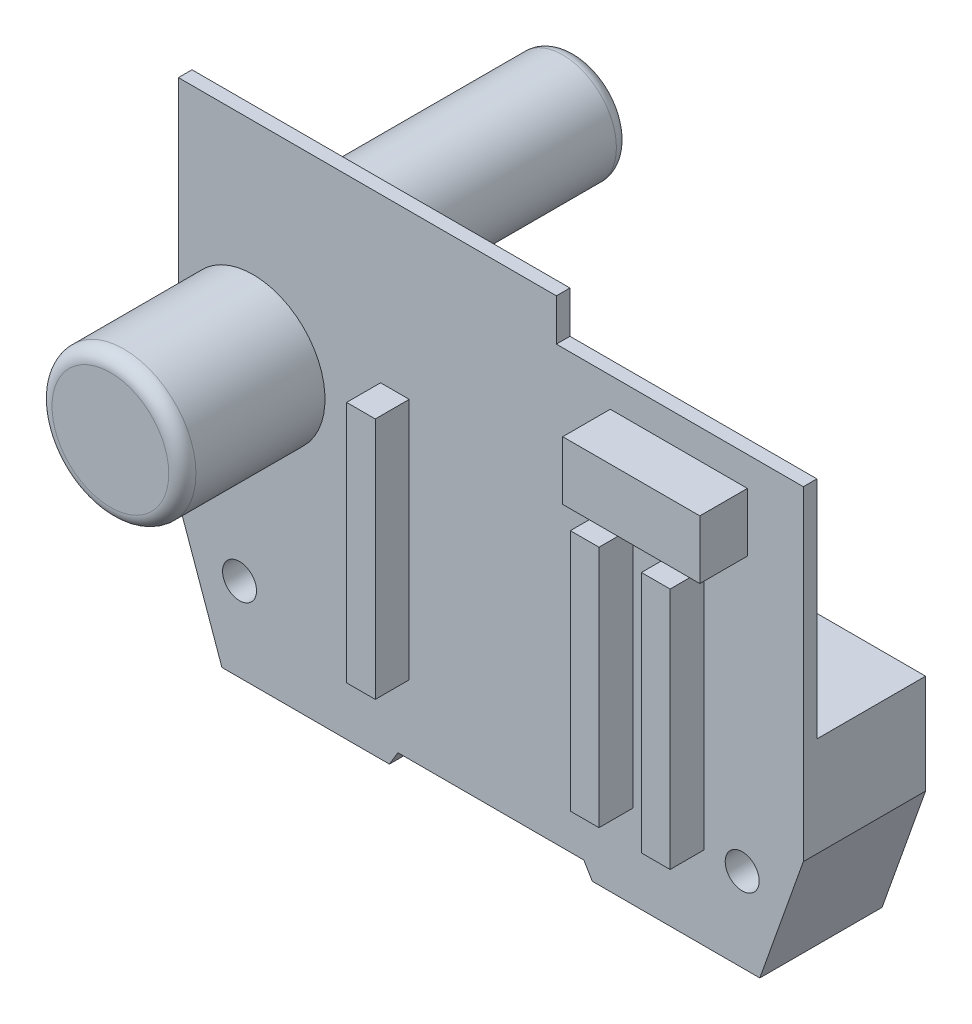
ISO-10303-21;
HEADER;
FILE_DESCRIPTION(('STEP AP214'),'2;1');
FILE_NAME('part.step','',(''),(''),'','','');
FILE_SCHEMA(('AUTOMOTIVE_DESIGN { 1 0 10303 214 1 1 1 1 }'));
ENDSEC;
DATA;
#1=APPLICATION_CONTEXT('core data for automotive mechanical design processes');
#2=APPLICATION_PROTOCOL_DEFINITION('international standard','automotive_design',2000,#1);
#3=PRODUCT_CONTEXT('',#1,'mechanical');
#4=PRODUCT('Part','Part','',(#3));
#5=PRODUCT_RELATED_PRODUCT_CATEGORY('part','',(#4));
#6=PRODUCT_DEFINITION_FORMATION('','',#4);
#7=PRODUCT_DEFINITION_CONTEXT('part definition',#1,'design');
#8=PRODUCT_DEFINITION('design','',#6,#7);
#9=PRODUCT_DEFINITION_SHAPE('','',#8);
#10=(LENGTH_UNIT() NAMED_UNIT(*) SI_UNIT(.MILLI.,.METRE.));
#11=(NAMED_UNIT(*) PLANE_ANGLE_UNIT() SI_UNIT($,.RADIAN.));
#12=(NAMED_UNIT(*) SI_UNIT($,.STERADIAN.) SOLID_ANGLE_UNIT());
#13=UNCERTAINTY_MEASURE_WITH_UNIT(LENGTH_MEASURE(1.E-05),#10,'distance_accuracy_value','');
#14=(GEOMETRIC_REPRESENTATION_CONTEXT(3) GLOBAL_UNCERTAINTY_ASSIGNED_CONTEXT((#13)) GLOBAL_UNIT_ASSIGNED_CONTEXT((#10,
#11,#12)) REPRESENTATION_CONTEXT('',''));
#15=CARTESIAN_POINT('',(0.,0.,0.));
#16=DIRECTION('',(0.,0.,1.));
#17=DIRECTION('',(1.,0.,0.));
#18=AXIS2_PLACEMENT_3D('',#15,#16,#17);
#19=CARTESIAN_POINT('',(-92.,0.,0.));
#20=DIRECTION('',(0.,0.,1.));
#21=DIRECTION('',(1.,0.,0.));
#22=AXIS2_PLACEMENT_3D('',#19,#20,#21);
#23=PLANE('',#22);
#24=DIRECTION('',(1.,0.,0.));
#25=VECTOR('',#24,1.);
#26=CARTESIAN_POINT('',(0.,32.6877580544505,0.));
#27=LINE('',#26,#25);
#28=CARTESIAN_POINT('',(-92.,32.6877580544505,0.));
#29=VERTEX_POINT('',#28);
#30=CARTESIAN_POINT('',(0.,32.6877580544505,0.));
#31=VERTEX_POINT('',#30);
#32=EDGE_CURVE('E46',#29,#31,#27,.T.);
#33=ORIENTED_EDGE('',*,*,#32,.F.);
#34=DIRECTION('',(0.,-1.,0.));
#35=VECTOR('',#34,1.);
#36=CARTESIAN_POINT('',(-92.,72.,0.));
#37=LINE('',#36,#35);
#38=CARTESIAN_POINT('',(-92.,72.,0.));
#39=VERTEX_POINT('',#38);
#40=EDGE_CURVE('E236',#39,#29,#37,.T.);
#41=ORIENTED_EDGE('',*,*,#40,.F.);
#42=DIRECTION('',(-1.,0.,0.));
#43=VECTOR('',#42,1.);
#44=CARTESIAN_POINT('',(-92.,72.,0.));
#45=LINE('',#44,#43);
#46=CARTESIAN_POINT('',(-36.3563524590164,72.,0.));
#47=VERTEX_POINT('',#46);
#48=EDGE_CURVE('E562',#47,#39,#45,.T.);
#49=ORIENTED_EDGE('',*,*,#48,.F.);
#50=DIRECTION('',(0.,1.,0.));
#51=VECTOR('',#50,1.);
#52=CARTESIAN_POINT('',(-36.3563524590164,72.,0.));
#53=LINE('',#52,#51);
#54=CARTESIAN_POINT('',(-36.3563524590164,65.8422131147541,0.));
#55=VERTEX_POINT('',#54);
#56=EDGE_CURVE('E564',#55,#47,#53,.T.);
#57=ORIENTED_EDGE('',*,*,#56,.F.);
#58=DIRECTION('',(-1.,0.,0.));
#59=VECTOR('',#58,1.);
#60=CARTESIAN_POINT('',(-36.3563524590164,65.8422131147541,0.));
#61=LINE('',#60,#59);
#62=CARTESIAN_POINT('',(0.,65.8422131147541,0.));
#63=VERTEX_POINT('',#62);
#64=EDGE_CURVE('E231',#63,#55,#61,.T.);
#65=ORIENTED_EDGE('',*,*,#64,.F.);
#66=DIRECTION('',(0.,1.,0.));
#67=VECTOR('',#66,1.);
#68=CARTESIAN_POINT('',(0.,65.8422131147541,0.));
#69=LINE('',#68,#67);
#70=EDGE_CURVE('E228',#31,#63,#69,.T.);
#71=ORIENTED_EDGE('',*,*,#70,.F.);
#72=EDGE_LOOP('',(#33,#41,#49,#57,#65,#71));
#73=FACE_BOUND('',#72,.T.);
#74=CARTESIAN_POINT('',(-71.3971763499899,59.3113238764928,0.));
#75=DIRECTION('',(0.,0.,1.));
#76=DIRECTION('',(1.,0.,0.));
#77=AXIS2_PLACEMENT_3D('',#74,#75,#76);
#78=CIRCLE('',#77,7.87992780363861);
#79=CARTESIAN_POINT('',(-63.5172485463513,59.3113238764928,0.));
#80=VERTEX_POINT('',#79);
#81=EDGE_CURVE('E266',#80,#80,#78,.F.);
#82=ORIENTED_EDGE('',*,*,#81,.F.);
#83=EDGE_LOOP('',(#82));
#84=FACE_BOUND('',#83,.T.);
#85=ADVANCED_FACE('F29',(#73,#84),#23,.F.);
#86=CARTESIAN_POINT('',(-92.,0.,2.));
#87=DIRECTION('',(0.,0.,1.));
#88=DIRECTION('',(1.,0.,0.));
#89=AXIS2_PLACEMENT_3D('',#86,#87,#88);
#90=PLANE('',#89);
#91=DIRECTION('',(-1.,0.,0.));
#92=VECTOR('',#91,1.);
#93=CARTESIAN_POINT('',(-29.2991252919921,48.0878118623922,2.));
#94=LINE('',#93,#92);
#95=CARTESIAN_POINT('',(-25.0800503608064,48.0878118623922,2.));
#96=VERTEX_POINT('',#95);
#97=CARTESIAN_POINT('',(-29.2991252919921,48.0878118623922,2.));
#98=VERTEX_POINT('',#97);
#99=EDGE_CURVE('E417',#96,#98,#94,.T.);
#100=ORIENTED_EDGE('',*,*,#99,.F.);
#101=DIRECTION('',(0.,1.,0.));
#102=VECTOR('',#101,1.);
#103=CARTESIAN_POINT('',(-25.0800503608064,48.0878118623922,2.));
#104=LINE('',#103,#102);
#105=CARTESIAN_POINT('',(-25.0800503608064,12.3274283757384,2.));
#106=VERTEX_POINT('',#105);
#107=EDGE_CURVE('E414',#106,#96,#104,.T.);
#108=ORIENTED_EDGE('',*,*,#107,.F.);
#109=DIRECTION('',(1.,0.,0.));
#110=VECTOR('',#109,1.);
#111=CARTESIAN_POINT('',(-29.2991252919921,12.3274283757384,2.));
#112=LINE('',#111,#110);
#113=CARTESIAN_POINT('',(-29.2991252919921,12.3274283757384,2.));
#114=VERTEX_POINT('',#113);
#115=EDGE_CURVE('E422',#114,#106,#112,.T.);
#116=ORIENTED_EDGE('',*,*,#115,.F.);
#117=DIRECTION('',(0.,-1.,0.));
#118=VECTOR('',#117,1.);
#119=CARTESIAN_POINT('',(-29.2991252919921,48.0878118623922,2.));
#120=LINE('',#119,#118);
#121=EDGE_CURVE('E419',#98,#114,#120,.T.);
#122=ORIENTED_EDGE('',*,*,#121,.F.);
#123=EDGE_LOOP('',(#100,#108,#116,#122));
#124=FACE_BOUND('',#123,.T.);
#125=DIRECTION('',(1.,0.,0.));
#126=VECTOR('',#125,1.);
#127=CARTESIAN_POINT('',(-28.4199991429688,52.8750444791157,2.));
#128=LINE('',#127,#126);
#129=CARTESIAN_POINT('',(-28.4199991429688,52.8750444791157,2.));
#130=VERTEX_POINT('',#129);
#131=CARTESIAN_POINT('',(-8.23514536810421,52.8750444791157,2.));
#132=VERTEX_POINT('',#131);
#133=EDGE_CURVE('E475',#130,#132,#128,.T.);
#134=ORIENTED_EDGE('',*,*,#133,.F.);
#135=DIRECTION('',(0.,-1.,0.));
#136=VECTOR('',#135,1.);
#137=CARTESIAN_POINT('',(-28.4199991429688,61.506325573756,2.));
#138=LINE('',#137,#136);
#139=CARTESIAN_POINT('',(-28.4199991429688,61.506325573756,2.));
#140=VERTEX_POINT('',#139);
#141=EDGE_CURVE('E472',#140,#130,#138,.T.);
#142=ORIENTED_EDGE('',*,*,#141,.F.);
#143=DIRECTION('',(-1.,0.,0.));
#144=VECTOR('',#143,1.);
#145=CARTESIAN_POINT('',(-28.4199991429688,61.506325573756,2.));
#146=LINE('',#145,#144);
#147=CARTESIAN_POINT('',(-8.23514536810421,61.506325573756,2.));
#148=VERTEX_POINT('',#147);
#149=EDGE_CURVE('E480',#148,#140,#146,.T.);
#150=ORIENTED_EDGE('',*,*,#149,.F.);
#151=DIRECTION('',(0.,1.,0.));
#152=VECTOR('',#151,1.);
#153=CARTESIAN_POINT('',(-8.23514536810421,61.506325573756,2.));
#154=LINE('',#153,#152);
#155=EDGE_CURVE('E477',#132,#148,#154,.T.);
#156=ORIENTED_EDGE('',*,*,#155,.F.);
#157=EDGE_LOOP('',(#134,#142,#150,#156));
#158=FACE_BOUND('',#157,.T.);
#159=CARTESIAN_POINT('',(-8.99999999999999,12.309631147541,2.));
#160=DIRECTION('',(0.,0.,1.));
#161=DIRECTION('',(-1.,0.,0.));
#162=AXIS2_PLACEMENT_3D('',#159,#160,#161);
#163=CIRCLE('',#162,2.5);
#164=CARTESIAN_POINT('',(-11.5,12.309631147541,2.));
#165=VERTEX_POINT('',#164);
#166=EDGE_CURVE('E504',#165,#165,#163,.T.);
#167=ORIENTED_EDGE('',*,*,#166,.F.);
#168=EDGE_LOOP('',(#167));
#169=FACE_BOUND('',#168,.T.);
#170=DIRECTION('',(0.,-1.,0.));
#171=VECTOR('',#170,1.);
#172=CARTESIAN_POINT('',(-92.,72.,2.));
#173=LINE('',#172,#171);
#174=CARTESIAN_POINT('',(-92.,72.,2.));
#175=VERTEX_POINT('',#174);
#176=CARTESIAN_POINT('',(-92.,18.0350409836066,2.));
#177=VERTEX_POINT('',#176);
#178=EDGE_CURVE('E560',#175,#177,#173,.T.);
#179=ORIENTED_EDGE('',*,*,#178,.T.);
#180=DIRECTION('',(0.334669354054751,-0.942335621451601,0.));
#181=VECTOR('',#180,1.);
#182=CARTESIAN_POINT('',(-92.,18.0350409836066,2.));
#183=LINE('',#182,#181);
#184=CARTESIAN_POINT('',(-85.5948770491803,0.,2.));
#185=VERTEX_POINT('',#184);
#186=EDGE_CURVE('E359',#177,#185,#183,.T.);
#187=ORIENTED_EDGE('',*,*,#186,.T.);
#188=DIRECTION('',(1.,0.,0.));
#189=VECTOR('',#188,1.);
#190=CARTESIAN_POINT('',(-85.5948770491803,0.,2.));
#191=LINE('',#190,#189);
#192=CARTESIAN_POINT('',(-60.9345193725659,0.,2.));
#193=VERTEX_POINT('',#192);
#194=EDGE_CURVE('E557',#185,#193,#191,.T.);
#195=ORIENTED_EDGE('',*,*,#194,.T.);
#196=DIRECTION('',(0.514507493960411,0.857485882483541,0.));
#197=VECTOR('',#196,1.);
#198=CARTESIAN_POINT('',(-60.9345193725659,0.,2.));
#199=LINE('',#198,#197);
#200=CARTESIAN_POINT('',(-59.6824641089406,2.08669402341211,2.));
#201=VERTEX_POINT('',#200);
#202=EDGE_CURVE('E555',#193,#201,#199,.T.);
#203=ORIENTED_EDGE('',*,*,#202,.T.);
#204=DIRECTION('',(1.,0.,0.));
#205=VECTOR('',#204,1.);
#206=CARTESIAN_POINT('',(-59.6824641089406,2.08669402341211,2.));
#207=LINE('',#206,#205);
#208=CARTESIAN_POINT('',(-32.3175358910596,2.08669402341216,2.));
#209=VERTEX_POINT('',#208);
#210=EDGE_CURVE('E553',#201,#209,#207,.T.);
#211=ORIENTED_EDGE('',*,*,#210,.T.);
#212=DIRECTION('',(0.51450749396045,-0.857485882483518,0.));
#213=VECTOR('',#212,1.);
#214=CARTESIAN_POINT('',(-31.0654806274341,0.,2.));
#215=LINE('',#214,#213);
#216=CARTESIAN_POINT('',(-31.0654806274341,0.,2.));
#217=VERTEX_POINT('',#216);
#218=EDGE_CURVE('E551',#209,#217,#215,.T.);
#219=ORIENTED_EDGE('',*,*,#218,.T.);
#220=DIRECTION('',(1.,0.,0.));
#221=VECTOR('',#220,1.);
#222=CARTESIAN_POINT('',(-31.0654806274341,0.,2.));
#223=LINE('',#222,#221);
#224=CARTESIAN_POINT('',(-6.40512295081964,0.,2.));
#225=VERTEX_POINT('',#224);
#226=EDGE_CURVE('E549',#217,#225,#223,.T.);
#227=ORIENTED_EDGE('',*,*,#226,.T.);
#228=DIRECTION('',(0.334669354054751,0.942335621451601,0.));
#229=VECTOR('',#228,1.);
#230=CARTESIAN_POINT('',(0.,18.0350409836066,2.));
#231=LINE('',#230,#229);
#232=CARTESIAN_POINT('',(0.,18.0350409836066,2.));
#233=VERTEX_POINT('',#232);
#234=EDGE_CURVE('E547',#225,#233,#231,.T.);
#235=ORIENTED_EDGE('',*,*,#234,.T.);
#236=DIRECTION('',(0.,1.,0.));
#237=VECTOR('',#236,1.);
#238=CARTESIAN_POINT('',(0.,65.8422131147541,2.));
#239=LINE('',#238,#237);
#240=CARTESIAN_POINT('',(0.,65.8422131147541,2.));
#241=VERTEX_POINT('',#240);
#242=EDGE_CURVE('E545',#233,#241,#239,.T.);
#243=ORIENTED_EDGE('',*,*,#242,.T.);
#244=DIRECTION('',(-1.,0.,0.));
#245=VECTOR('',#244,1.);
#246=CARTESIAN_POINT('',(-36.3563524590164,65.8422131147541,2.));
#247=LINE('',#246,#245);
#248=CARTESIAN_POINT('',(-36.3563524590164,65.8422131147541,2.));
#249=VERTEX_POINT('',#248);
#250=EDGE_CURVE('E543',#241,#249,#247,.T.);
#251=ORIENTED_EDGE('',*,*,#250,.T.);
#252=DIRECTION('',(0.,1.,0.));
#253=VECTOR('',#252,1.);
#254=CARTESIAN_POINT('',(-36.3563524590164,72.,2.));
#255=LINE('',#254,#253);
#256=CARTESIAN_POINT('',(-36.3563524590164,72.,2.));
#257=VERTEX_POINT('',#256);
#258=EDGE_CURVE('E541',#249,#257,#255,.T.);
#259=ORIENTED_EDGE('',*,*,#258,.T.);
#260=DIRECTION('',(-1.,0.,0.));
#261=VECTOR('',#260,1.);
#262=CARTESIAN_POINT('',(-92.,72.,2.));
#263=LINE('',#262,#261);
#264=EDGE_CURVE('E539',#257,#175,#263,.T.);
#265=ORIENTED_EDGE('',*,*,#264,.T.);
#266=EDGE_LOOP('',(#179,#187,#195,#203,#211,#219,#227,#235,#243,#251,#259,#265));
#267=FACE_BOUND('',#266,.T.);
#268=CARTESIAN_POINT('',(-83.,12.309631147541,2.));
#269=DIRECTION('',(0.,0.,1.));
#270=DIRECTION('',(1.,0.,0.));
#271=AXIS2_PLACEMENT_3D('',#268,#269,#270);
#272=CIRCLE('',#271,2.5);
#273=CARTESIAN_POINT('',(-80.5,12.309631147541,2.));
#274=VERTEX_POINT('',#273);
#275=EDGE_CURVE('E506',#274,#274,#272,.T.);
#276=ORIENTED_EDGE('',*,*,#275,.F.);
#277=EDGE_LOOP('',(#276));
#278=FACE_BOUND('',#277,.T.);
#279=CARTESIAN_POINT('',(-81.0115867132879,41.7956883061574,2.));
#280=DIRECTION('',(0.,0.,1.));
#281=DIRECTION('',(1.,0.,0.));
#282=AXIS2_PLACEMENT_3D('',#279,#280,#281);
#283=CIRCLE('',#282,10.5931506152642);
#284=CARTESIAN_POINT('',(-91.6047373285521,41.7956883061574,2.));
#285=VERTEX_POINT('',#284);
#286=EDGE_CURVE('E501',#285,#285,#283,.T.);
#287=ORIENTED_EDGE('',*,*,#286,.F.);
#288=EDGE_LOOP('',(#287));
#289=FACE_BOUND('',#288,.T.);
#290=DIRECTION('',(1.,0.,0.));
#291=VECTOR('',#290,1.);
#292=CARTESIAN_POINT('',(-18.8329019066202,12.2283973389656,2.));
#293=LINE('',#292,#291);
#294=CARTESIAN_POINT('',(-18.8329019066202,12.2283973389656,2.));
#295=VERTEX_POINT('',#294);
#296=CARTESIAN_POINT('',(-14.6138269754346,12.2283973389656,2.));
#297=VERTEX_POINT('',#296);
#298=EDGE_CURVE('E446',#295,#297,#293,.T.);
#299=ORIENTED_EDGE('',*,*,#298,.F.);
#300=DIRECTION('',(0.,-1.,0.));
#301=VECTOR('',#300,1.);
#302=CARTESIAN_POINT('',(-18.8329019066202,47.9887808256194,2.));
#303=LINE('',#302,#301);
#304=CARTESIAN_POINT('',(-18.8329019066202,47.9887808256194,2.));
#305=VERTEX_POINT('',#304);
#306=EDGE_CURVE('E443',#305,#295,#303,.T.);
#307=ORIENTED_EDGE('',*,*,#306,.F.);
#308=DIRECTION('',(-1.,0.,0.));
#309=VECTOR('',#308,1.);
#310=CARTESIAN_POINT('',(-18.8329019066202,47.9887808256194,2.));
#311=LINE('',#310,#309);
#312=CARTESIAN_POINT('',(-14.6138269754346,47.9887808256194,2.));
#313=VERTEX_POINT('',#312);
#314=EDGE_CURVE('E451',#313,#305,#311,.T.);
#315=ORIENTED_EDGE('',*,*,#314,.F.);
#316=DIRECTION('',(0.,1.,0.));
#317=VECTOR('',#316,1.);
#318=CARTESIAN_POINT('',(-14.6138269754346,47.9887808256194,2.));
#319=LINE('',#318,#317);
#320=EDGE_CURVE('E448',#297,#313,#319,.T.);
#321=ORIENTED_EDGE('',*,*,#320,.F.);
#322=EDGE_LOOP('',(#299,#307,#315,#321));
#323=FACE_BOUND('',#322,.T.);
#324=DIRECTION('',(-1.,0.,0.));
#325=VECTOR('',#324,1.);
#326=CARTESIAN_POINT('',(-62.23495790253,47.9720799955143,2.));
#327=LINE('',#326,#325);
#328=CARTESIAN_POINT('',(-58.0158829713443,47.9720799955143,2.));
#329=VERTEX_POINT('',#328);
#330=CARTESIAN_POINT('',(-62.23495790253,47.9720799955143,2.));
#331=VERTEX_POINT('',#330);
#332=EDGE_CURVE('E390',#329,#331,#327,.T.);
#333=ORIENTED_EDGE('',*,*,#332,.F.);
#334=DIRECTION('',(0.,1.,0.));
#335=VECTOR('',#334,1.);
#336=CARTESIAN_POINT('',(-58.0158829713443,47.9720799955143,2.));
#337=LINE('',#336,#335);
#338=CARTESIAN_POINT('',(-58.0158829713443,12.2116965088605,2.));
#339=VERTEX_POINT('',#338);
#340=EDGE_CURVE('E255',#339,#329,#337,.T.);
#341=ORIENTED_EDGE('',*,*,#340,.F.);
#342=DIRECTION('',(1.,0.,0.));
#343=VECTOR('',#342,1.);
#344=CARTESIAN_POINT('',(-62.23495790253,12.2116965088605,2.));
#345=LINE('',#344,#343);
#346=CARTESIAN_POINT('',(-62.23495790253,12.2116965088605,2.));
#347=VERTEX_POINT('',#346);
#348=EDGE_CURVE('E394',#347,#339,#345,.T.);
#349=ORIENTED_EDGE('',*,*,#348,.F.);
#350=DIRECTION('',(0.,-1.,0.));
#351=VECTOR('',#350,1.);
#352=CARTESIAN_POINT('',(-62.23495790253,47.9720799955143,2.));
#353=LINE('',#352,#351);
#354=EDGE_CURVE('E392',#331,#347,#353,.T.);
#355=ORIENTED_EDGE('',*,*,#354,.F.);
#356=EDGE_LOOP('',(#333,#341,#349,#355));
#357=FACE_BOUND('',#356,.T.);
#358=ADVANCED_FACE('F303',(#124,#158,#169,#267,#278,#289,#323,#357),#90,.T.);
#359=CARTESIAN_POINT('',(-92.,72.,2.));
#360=DIRECTION('',(1.,0.,0.));
#361=DIRECTION('',(0.,0.,-1.));
#362=AXIS2_PLACEMENT_3D('',#359,#360,#361);
#363=PLANE('',#362);
#364=ORIENTED_EDGE('',*,*,#40,.T.);
#365=DIRECTION('',(0.,0.,1.));
#366=VECTOR('',#365,1.);
#367=CARTESIAN_POINT('',(-92.,32.6877580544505,-16.));
#368=LINE('',#367,#366);
#369=CARTESIAN_POINT('',(-92.,32.6877580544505,-16.));
#370=VERTEX_POINT('',#369);
#371=EDGE_CURVE('E246',#370,#29,#368,.T.);
#372=ORIENTED_EDGE('',*,*,#371,.F.);
#373=DIRECTION('',(0.,1.,0.));
#374=VECTOR('',#373,1.);
#375=CARTESIAN_POINT('',(-92.,18.0350409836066,-16.));
#376=LINE('',#375,#374);
#377=CARTESIAN_POINT('',(-92.,18.0350409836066,-16.));
#378=VERTEX_POINT('',#377);
#379=EDGE_CURVE('E364',#378,#370,#376,.T.);
#380=ORIENTED_EDGE('',*,*,#379,.F.);
#381=DIRECTION('',(0.,0.,-1.));
#382=VECTOR('',#381,1.);
#383=CARTESIAN_POINT('',(-92.,18.0350409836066,2.));
#384=LINE('',#383,#382);
#385=EDGE_CURVE('E270',#177,#378,#384,.T.);
#386=ORIENTED_EDGE('',*,*,#385,.F.);
#387=ORIENTED_EDGE('',*,*,#178,.F.);
#388=DIRECTION('',(0.,0.,-1.));
#389=VECTOR('',#388,1.);
#390=CARTESIAN_POINT('',(-92.,72.,2.));
#391=LINE('',#390,#389);
#392=EDGE_CURVE('E536',#175,#39,#391,.T.);
#393=ORIENTED_EDGE('',*,*,#392,.T.);
#394=EDGE_LOOP('',(#364,#372,#380,#386,#387,#393));
#395=FACE_BOUND('',#394,.T.);
#396=ADVANCED_FACE('F31',(#395),#363,.F.);
#397=CARTESIAN_POINT('',(-92.,18.0350409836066,2.));
#398=DIRECTION('',(0.942335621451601,0.334669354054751,0.));
#399=DIRECTION('',(-0.334669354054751,0.942335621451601,0.));
#400=AXIS2_PLACEMENT_3D('',#397,#398,#399);
#401=PLANE('',#400);
#402=ORIENTED_EDGE('',*,*,#385,.T.);
#403=DIRECTION('',(-0.334669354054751,0.942335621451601,0.));
#404=VECTOR('',#403,1.);
#405=CARTESIAN_POINT('',(-85.5948770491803,0.,-16.));
#406=LINE('',#405,#404);
#407=CARTESIAN_POINT('',(-85.5948770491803,0.,-16.));
#408=VERTEX_POINT('',#407);
#409=EDGE_CURVE('E247',#408,#378,#406,.T.);
#410=ORIENTED_EDGE('',*,*,#409,.F.);
#411=DIRECTION('',(0.,0.,-1.));
#412=VECTOR('',#411,1.);
#413=CARTESIAN_POINT('',(-85.5948770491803,0.,2.));
#414=LINE('',#413,#412);
#415=EDGE_CURVE('E362',#185,#408,#414,.T.);
#416=ORIENTED_EDGE('',*,*,#415,.F.);
#417=ORIENTED_EDGE('',*,*,#186,.F.);
#418=EDGE_LOOP('',(#402,#410,#416,#417));
#419=FACE_BOUND('',#418,.T.);
#420=ADVANCED_FACE('F346',(#419),#401,.F.);
#421=CARTESIAN_POINT('',(-85.5948770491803,0.,2.));
#422=DIRECTION('',(0.,1.,0.));
#423=DIRECTION('',(0.,0.,1.));
#424=AXIS2_PLACEMENT_3D('',#421,#422,#423);
#425=PLANE('',#424);
#426=ORIENTED_EDGE('',*,*,#415,.T.);
#427=DIRECTION('',(-1.,0.,0.));
#428=VECTOR('',#427,1.);
#429=CARTESIAN_POINT('',(-60.9345193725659,0.,-16.));
#430=LINE('',#429,#428);
#431=CARTESIAN_POINT('',(-60.9345193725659,0.,-16.));
#432=VERTEX_POINT('',#431);
#433=EDGE_CURVE('E253',#432,#408,#430,.T.);
#434=ORIENTED_EDGE('',*,*,#433,.F.);
#435=DIRECTION('',(0.,0.,-1.));
#436=VECTOR('',#435,1.);
#437=CARTESIAN_POINT('',(-60.9345193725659,0.,2.));
#438=LINE('',#437,#436);
#439=EDGE_CURVE('E516',#193,#432,#438,.T.);
#440=ORIENTED_EDGE('',*,*,#439,.F.);
#441=ORIENTED_EDGE('',*,*,#194,.F.);
#442=EDGE_LOOP('',(#426,#434,#440,#441));
#443=FACE_BOUND('',#442,.T.);
#444=ADVANCED_FACE('F343',(#443),#425,.F.);
#445=CARTESIAN_POINT('',(-60.9345193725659,0.,2.));
#446=DIRECTION('',(-0.857485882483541,0.514507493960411,0.));
#447=DIRECTION('',(-0.514507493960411,-0.857485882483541,0.));
#448=AXIS2_PLACEMENT_3D('',#445,#446,#447);
#449=PLANE('',#448);
#450=ORIENTED_EDGE('',*,*,#439,.T.);
#451=DIRECTION('',(-0.514507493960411,-0.857485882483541,0.));
#452=VECTOR('',#451,1.);
#453=CARTESIAN_POINT('',(-59.6824641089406,2.08669402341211,-16.));
#454=LINE('',#453,#452);
#455=CARTESIAN_POINT('',(-59.6824641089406,2.08669402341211,-16.));
#456=VERTEX_POINT('',#455);
#457=EDGE_CURVE('E258',#456,#432,#454,.T.);
#458=ORIENTED_EDGE('',*,*,#457,.F.);
#459=DIRECTION('',(0.,0.,-1.));
#460=VECTOR('',#459,1.);
#461=CARTESIAN_POINT('',(-59.6824641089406,2.08669402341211,2.));
#462=LINE('',#461,#460);
#463=EDGE_CURVE('E518',#201,#456,#462,.T.);
#464=ORIENTED_EDGE('',*,*,#463,.F.);
#465=ORIENTED_EDGE('',*,*,#202,.F.);
#466=EDGE_LOOP('',(#450,#458,#464,#465));
#467=FACE_BOUND('',#466,.T.);
#468=ADVANCED_FACE('F339',(#467),#449,.F.);
#469=CARTESIAN_POINT('',(-59.6824641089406,2.08669402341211,2.));
#470=DIRECTION('',(0.,1.,0.));
#471=DIRECTION('',(-1.,0.,0.));
#472=AXIS2_PLACEMENT_3D('',#469,#470,#471);
#473=PLANE('',#472);
#474=ORIENTED_EDGE('',*,*,#463,.T.);
#475=DIRECTION('',(-1.,0.,0.));
#476=VECTOR('',#475,1.);
#477=CARTESIAN_POINT('',(-32.3175358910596,2.08669402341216,-16.));
#478=LINE('',#477,#476);
#479=CARTESIAN_POINT('',(-32.3175358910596,2.08669402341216,-16.));
#480=VERTEX_POINT('',#479);
#481=EDGE_CURVE('E384',#480,#456,#478,.T.);
#482=ORIENTED_EDGE('',*,*,#481,.F.);
#483=DIRECTION('',(0.,0.,-1.));
#484=VECTOR('',#483,1.);
#485=CARTESIAN_POINT('',(-32.3175358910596,2.08669402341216,2.));
#486=LINE('',#485,#484);
#487=EDGE_CURVE('E520',#209,#480,#486,.T.);
#488=ORIENTED_EDGE('',*,*,#487,.F.);
#489=ORIENTED_EDGE('',*,*,#210,.F.);
#490=EDGE_LOOP('',(#474,#482,#488,#489));
#491=FACE_BOUND('',#490,.T.);
#492=ADVANCED_FACE('F335',(#491),#473,.F.);
#493=CARTESIAN_POINT('',(-31.0654806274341,0.,2.));
#494=DIRECTION('',(0.857485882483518,0.51450749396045,0.));
#495=DIRECTION('',(-0.51450749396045,0.857485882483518,0.));
#496=AXIS2_PLACEMENT_3D('',#493,#494,#495);
#497=PLANE('',#496);
#498=ORIENTED_EDGE('',*,*,#487,.T.);
#499=DIRECTION('',(-0.51450749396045,0.857485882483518,0.));
#500=VECTOR('',#499,1.);
#501=CARTESIAN_POINT('',(-31.0654806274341,0.,-16.));
#502=LINE('',#501,#500);
#503=CARTESIAN_POINT('',(-31.0654806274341,0.,-16.));
#504=VERTEX_POINT('',#503);
#505=EDGE_CURVE('E381',#504,#480,#502,.T.);
#506=ORIENTED_EDGE('',*,*,#505,.F.);
#507=DIRECTION('',(0.,0.,-1.));
#508=VECTOR('',#507,1.);
#509=CARTESIAN_POINT('',(-31.0654806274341,0.,2.));
#510=LINE('',#509,#508);
#511=EDGE_CURVE('E522',#217,#504,#510,.T.);
#512=ORIENTED_EDGE('',*,*,#511,.F.);
#513=ORIENTED_EDGE('',*,*,#218,.F.);
#514=EDGE_LOOP('',(#498,#506,#512,#513));
#515=FACE_BOUND('',#514,.T.);
#516=ADVANCED_FACE('F331',(#515),#497,.F.);
#517=CARTESIAN_POINT('',(-31.0654806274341,0.,2.));
#518=DIRECTION('',(0.,1.,0.));
#519=DIRECTION('',(0.,0.,1.));
#520=AXIS2_PLACEMENT_3D('',#517,#518,#519);
#521=PLANE('',#520);
#522=ORIENTED_EDGE('',*,*,#511,.T.);
#523=DIRECTION('',(-1.,0.,0.));
#524=VECTOR('',#523,1.);
#525=CARTESIAN_POINT('',(-6.40512295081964,0.,-16.));
#526=LINE('',#525,#524);
#527=CARTESIAN_POINT('',(-6.40512295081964,0.,-16.));
#528=VERTEX_POINT('',#527);
#529=EDGE_CURVE('E378',#528,#504,#526,.T.);
#530=ORIENTED_EDGE('',*,*,#529,.F.);
#531=DIRECTION('',(0.,0.,-1.));
#532=VECTOR('',#531,1.);
#533=CARTESIAN_POINT('',(-6.40512295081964,0.,2.));
#534=LINE('',#533,#532);
#535=EDGE_CURVE('E524',#225,#528,#534,.T.);
#536=ORIENTED_EDGE('',*,*,#535,.F.);
#537=ORIENTED_EDGE('',*,*,#226,.F.);
#538=EDGE_LOOP('',(#522,#530,#536,#537));
#539=FACE_BOUND('',#538,.T.);
#540=ADVANCED_FACE('F327',(#539),#521,.F.);
#541=CARTESIAN_POINT('',(0.,18.0350409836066,2.));
#542=DIRECTION('',(-0.942335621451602,0.334669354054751,0.));
#543=DIRECTION('',(-0.334669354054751,-0.942335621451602,0.));
#544=AXIS2_PLACEMENT_3D('',#541,#542,#543);
#545=PLANE('',#544);
#546=ORIENTED_EDGE('',*,*,#535,.T.);
#547=DIRECTION('',(-0.334669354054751,-0.942335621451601,0.));
#548=VECTOR('',#547,1.);
#549=CARTESIAN_POINT('',(0.,18.0350409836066,-16.));
#550=LINE('',#549,#548);
#551=CARTESIAN_POINT('',(0.,18.0350409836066,-16.));
#552=VERTEX_POINT('',#551);
#553=EDGE_CURVE('E375',#552,#528,#550,.T.);
#554=ORIENTED_EDGE('',*,*,#553,.F.);
#555=DIRECTION('',(0.,0.,-1.));
#556=VECTOR('',#555,1.);
#557=CARTESIAN_POINT('',(0.,18.0350409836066,2.));
#558=LINE('',#557,#556);
#559=EDGE_CURVE('E526',#233,#552,#558,.T.);
#560=ORIENTED_EDGE('',*,*,#559,.F.);
#561=ORIENTED_EDGE('',*,*,#234,.F.);
#562=EDGE_LOOP('',(#546,#554,#560,#561));
#563=FACE_BOUND('',#562,.T.);
#564=ADVANCED_FACE('F324',(#563),#545,.F.);
#565=CARTESIAN_POINT('',(0.,65.8422131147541,2.));
#566=DIRECTION('',(-1.,0.,0.));
#567=DIRECTION('',(0.,-1.,0.));
#568=AXIS2_PLACEMENT_3D('',#565,#566,#567);
#569=PLANE('',#568);
#570=ORIENTED_EDGE('',*,*,#559,.T.);
#571=DIRECTION('',(0.,-1.,0.));
#572=VECTOR('',#571,1.);
#573=CARTESIAN_POINT('',(0.,32.6877580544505,-16.));
#574=LINE('',#573,#572);
#575=CARTESIAN_POINT('',(0.,32.6877580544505,-16.));
#576=VERTEX_POINT('',#575);
#577=EDGE_CURVE('E252',#576,#552,#574,.T.);
#578=ORIENTED_EDGE('',*,*,#577,.F.);
#579=DIRECTION('',(0.,0.,1.));
#580=VECTOR('',#579,1.);
#581=CARTESIAN_POINT('',(0.,32.6877580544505,-16.));
#582=LINE('',#581,#580);
#583=EDGE_CURVE('E243',#576,#31,#582,.T.);
#584=ORIENTED_EDGE('',*,*,#583,.T.);
#585=ORIENTED_EDGE('',*,*,#70,.T.);
#586=DIRECTION('',(0.,0.,-1.));
#587=VECTOR('',#586,1.);
#588=CARTESIAN_POINT('',(0.,65.8422131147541,2.));
#589=LINE('',#588,#587);
#590=EDGE_CURVE('E528',#241,#63,#589,.T.);
#591=ORIENTED_EDGE('',*,*,#590,.F.);
#592=ORIENTED_EDGE('',*,*,#242,.F.);
#593=EDGE_LOOP('',(#570,#578,#584,#585,#591,#592));
#594=FACE_BOUND('',#593,.T.);
#595=ADVANCED_FACE('F250',(#594),#569,.F.);
#596=CARTESIAN_POINT('',(-36.3563524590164,65.8422131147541,2.));
#597=DIRECTION('',(0.,-1.,0.));
#598=DIRECTION('',(1.,0.,0.));
#599=AXIS2_PLACEMENT_3D('',#596,#597,#598);
#600=PLANE('',#599);
#601=ORIENTED_EDGE('',*,*,#64,.T.);
#602=DIRECTION('',(0.,0.,-1.));
#603=VECTOR('',#602,1.);
#604=CARTESIAN_POINT('',(-36.3563524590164,65.8422131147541,2.));
#605=LINE('',#604,#603);
#606=EDGE_CURVE('E530',#249,#55,#605,.T.);
#607=ORIENTED_EDGE('',*,*,#606,.F.);
#608=ORIENTED_EDGE('',*,*,#250,.F.);
#609=ORIENTED_EDGE('',*,*,#590,.T.);
#610=EDGE_LOOP('',(#601,#607,#608,#609));
#611=FACE_BOUND('',#610,.T.);
#612=ADVANCED_FACE('F317',(#611),#600,.F.);
#613=CARTESIAN_POINT('',(-36.3563524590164,72.,2.));
#614=DIRECTION('',(-1.,0.,0.));
#615=DIRECTION('',(0.,0.,1.));
#616=AXIS2_PLACEMENT_3D('',#613,#614,#615);
#617=PLANE('',#616);
#618=ORIENTED_EDGE('',*,*,#56,.T.);
#619=DIRECTION('',(0.,0.,-1.));
#620=VECTOR('',#619,1.);
#621=CARTESIAN_POINT('',(-36.3563524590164,72.,2.));
#622=LINE('',#621,#620);
#623=EDGE_CURVE('E533',#257,#47,#622,.T.);
#624=ORIENTED_EDGE('',*,*,#623,.F.);
#625=ORIENTED_EDGE('',*,*,#258,.F.);
#626=ORIENTED_EDGE('',*,*,#606,.T.);
#627=EDGE_LOOP('',(#618,#624,#625,#626));
#628=FACE_BOUND('',#627,.T.);
#629=ADVANCED_FACE('F313',(#628),#617,.F.);
#630=CARTESIAN_POINT('',(-92.,72.,2.));
#631=DIRECTION('',(0.,-1.,0.));
#632=DIRECTION('',(0.,0.,-1.));
#633=AXIS2_PLACEMENT_3D('',#630,#631,#632);
#634=PLANE('',#633);
#635=ORIENTED_EDGE('',*,*,#48,.T.);
#636=ORIENTED_EDGE('',*,*,#392,.F.);
#637=ORIENTED_EDGE('',*,*,#264,.F.);
#638=ORIENTED_EDGE('',*,*,#623,.T.);
#639=EDGE_LOOP('',(#635,#636,#637,#638));
#640=FACE_BOUND('',#639,.T.);
#641=ADVANCED_FACE('F298',(#640),#634,.F.);
#642=CARTESIAN_POINT('',(-83.,12.309631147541,2.));
#643=DIRECTION('',(0.,0.,-1.));
#644=DIRECTION('',(-1.,0.,0.));
#645=AXIS2_PLACEMENT_3D('',#642,#643,#644);
#646=CYLINDRICAL_SURFACE('',#645,2.5);
#647=ORIENTED_EDGE('',*,*,#275,.T.);
#648=EDGE_LOOP('',(#647));
#649=FACE_BOUND('',#648,.T.);
#650=CARTESIAN_POINT('',(-83.,12.309631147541,-16.));
#651=DIRECTION('',(0.,0.,1.));
#652=DIRECTION('',(1.,0.,0.));
#653=AXIS2_PLACEMENT_3D('',#650,#651,#652);
#654=CIRCLE('',#653,2.5);
#655=CARTESIAN_POINT('',(-80.5,12.309631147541,-16.));
#656=VERTEX_POINT('',#655);
#657=EDGE_CURVE('E248',#656,#656,#654,.T.);
#658=ORIENTED_EDGE('',*,*,#657,.F.);
#659=EDGE_LOOP('',(#658));
#660=FACE_BOUND('',#659,.T.);
#661=ADVANCED_FACE('F288',(#649,#660),#646,.F.);
#662=CARTESIAN_POINT('',(-8.99999999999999,12.309631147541,2.));
#663=DIRECTION('',(0.,0.,-1.));
#664=DIRECTION('',(-1.,0.,0.));
#665=AXIS2_PLACEMENT_3D('',#662,#663,#664);
#666=CYLINDRICAL_SURFACE('',#665,2.5);
#667=ORIENTED_EDGE('',*,*,#166,.T.);
#668=EDGE_LOOP('',(#667));
#669=FACE_BOUND('',#668,.T.);
#670=CARTESIAN_POINT('',(-8.99999999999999,12.309631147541,-16.));
#671=DIRECTION('',(0.,0.,1.));
#672=DIRECTION('',(1.,0.,0.));
#673=AXIS2_PLACEMENT_3D('',#670,#671,#672);
#674=CIRCLE('',#673,2.5);
#675=CARTESIAN_POINT('',(-6.49999999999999,12.309631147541,-16.));
#676=VERTEX_POINT('',#675);
#677=EDGE_CURVE('E33',#676,#676,#674,.T.);
#678=ORIENTED_EDGE('',*,*,#677,.F.);
#679=EDGE_LOOP('',(#678));
#680=FACE_BOUND('',#679,.T.);
#681=ADVANCED_FACE('F285',(#669,#680),#666,.F.);
#682=CARTESIAN_POINT('',(-81.0115867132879,41.7956883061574,23.));
#683=DIRECTION('',(0.,0.,-1.));
#684=DIRECTION('',(-1.,0.,0.));
#685=AXIS2_PLACEMENT_3D('',#682,#683,#684);
#686=CYLINDRICAL_SURFACE('',#685,10.5931506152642);
#687=CARTESIAN_POINT('',(-81.0115867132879,41.7956883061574,21.));
#688=DIRECTION('',(0.,0.,1.));
#689=DIRECTION('',(1.,0.,0.));
#690=AXIS2_PLACEMENT_3D('',#687,#688,#689);
#691=CIRCLE('',#690,10.5931506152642);
#692=CARTESIAN_POINT('',(-91.6047373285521,41.7956883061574,21.));
#693=VERTEX_POINT('',#692);
#694=EDGE_CURVE('E273',#693,#693,#691,.F.);
#695=CARTESIAN_POINT('',(-91.6047373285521,41.7956883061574,21.));
#696=CARTESIAN_POINT('',(-91.6047373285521,41.7956883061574,20.8020833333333));
#697=CARTESIAN_POINT('',(-91.6047373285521,41.7956883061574,20.6041666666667));
#698=CARTESIAN_POINT('',(-91.6047373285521,41.7956883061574,20.2083333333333));
#699=CARTESIAN_POINT('',(-91.6047373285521,41.7956883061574,20.0104166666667));
#700=CARTESIAN_POINT('',(-91.6047373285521,41.7956883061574,19.6145833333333));
#701=CARTESIAN_POINT('',(-91.6047373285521,41.7956883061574,19.4166666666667));
#702=CARTESIAN_POINT('',(-91.6047373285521,41.7956883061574,19.0208333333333));
#703=CARTESIAN_POINT('',(-91.6047373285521,41.7956883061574,18.8229166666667));
#704=CARTESIAN_POINT('',(-91.6047373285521,41.7956883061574,18.4270833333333));
#705=CARTESIAN_POINT('',(-91.6047373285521,41.7956883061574,18.2291666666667));
#706=CARTESIAN_POINT('',(-91.6047373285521,41.7956883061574,17.8333333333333));
#707=CARTESIAN_POINT('',(-91.6047373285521,41.7956883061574,17.6354166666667));
#708=CARTESIAN_POINT('',(-91.6047373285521,41.7956883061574,17.2395833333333));
#709=CARTESIAN_POINT('',(-91.6047373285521,41.7956883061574,17.0416666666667));
#710=CARTESIAN_POINT('',(-91.6047373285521,41.7956883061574,16.6458333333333));
#711=CARTESIAN_POINT('',(-91.6047373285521,41.7956883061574,16.4479166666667));
#712=CARTESIAN_POINT('',(-91.6047373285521,41.7956883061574,16.0520833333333));
#713=CARTESIAN_POINT('',(-91.6047373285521,41.7956883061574,15.8541666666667));
#714=CARTESIAN_POINT('',(-91.6047373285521,41.7956883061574,15.4583333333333));
#715=CARTESIAN_POINT('',(-91.6047373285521,41.7956883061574,15.2604166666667));
#716=CARTESIAN_POINT('',(-91.6047373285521,41.7956883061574,14.8645833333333));
#717=CARTESIAN_POINT('',(-91.6047373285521,41.7956883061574,14.6666666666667));
#718=CARTESIAN_POINT('',(-91.6047373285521,41.7956883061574,14.2708333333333));
#719=CARTESIAN_POINT('',(-91.6047373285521,41.7956883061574,14.0729166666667));
#720=CARTESIAN_POINT('',(-91.6047373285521,41.7956883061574,13.6770833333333));
#721=CARTESIAN_POINT('',(-91.6047373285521,41.7956883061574,13.4791666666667));
#722=CARTESIAN_POINT('',(-91.6047373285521,41.7956883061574,13.0833333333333));
#723=CARTESIAN_POINT('',(-91.6047373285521,41.7956883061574,12.8854166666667));
#724=CARTESIAN_POINT('',(-91.6047373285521,41.7956883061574,12.4895833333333));
#725=CARTESIAN_POINT('',(-91.6047373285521,41.7956883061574,12.2916666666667));
#726=CARTESIAN_POINT('',(-91.6047373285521,41.7956883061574,11.8958333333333));
#727=CARTESIAN_POINT('',(-91.6047373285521,41.7956883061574,11.6979166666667));
#728=CARTESIAN_POINT('',(-91.6047373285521,41.7956883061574,11.3020833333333));
#729=CARTESIAN_POINT('',(-91.6047373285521,41.7956883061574,11.1041666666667));
#730=CARTESIAN_POINT('',(-91.6047373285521,41.7956883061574,10.7083333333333));
#731=CARTESIAN_POINT('',(-91.6047373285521,41.7956883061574,10.5104166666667));
#732=CARTESIAN_POINT('',(-91.6047373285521,41.7956883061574,10.1145833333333));
#733=CARTESIAN_POINT('',(-91.6047373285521,41.7956883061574,9.91666666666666));
#734=CARTESIAN_POINT('',(-91.6047373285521,41.7956883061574,9.52083333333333));
#735=CARTESIAN_POINT('',(-91.6047373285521,41.7956883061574,9.32291666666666));
#736=CARTESIAN_POINT('',(-91.6047373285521,41.7956883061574,8.92708333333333));
#737=CARTESIAN_POINT('',(-91.6047373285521,41.7956883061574,8.72916666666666));
#738=CARTESIAN_POINT('',(-91.6047373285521,41.7956883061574,8.33333333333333));
#739=CARTESIAN_POINT('',(-91.6047373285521,41.7956883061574,8.13541666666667));
#740=CARTESIAN_POINT('',(-91.6047373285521,41.7956883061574,7.73958333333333));
#741=CARTESIAN_POINT('',(-91.6047373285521,41.7956883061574,7.54166666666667));
#742=CARTESIAN_POINT('',(-91.6047373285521,41.7956883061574,7.14583333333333));
#743=CARTESIAN_POINT('',(-91.6047373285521,41.7956883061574,6.94791666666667));
#744=CARTESIAN_POINT('',(-91.6047373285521,41.7956883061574,6.55208333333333));
#745=CARTESIAN_POINT('',(-91.6047373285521,41.7956883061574,6.35416666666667));
#746=CARTESIAN_POINT('',(-91.6047373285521,41.7956883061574,5.95833333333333));
#747=CARTESIAN_POINT('',(-91.6047373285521,41.7956883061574,5.76041666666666));
#748=CARTESIAN_POINT('',(-91.6047373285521,41.7956883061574,5.36458333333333));
#749=CARTESIAN_POINT('',(-91.6047373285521,41.7956883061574,5.16666666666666));
#750=CARTESIAN_POINT('',(-91.6047373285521,41.7956883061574,4.77083333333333));
#751=CARTESIAN_POINT('',(-91.6047373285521,41.7956883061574,4.57291666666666));
#752=CARTESIAN_POINT('',(-91.6047373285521,41.7956883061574,4.17708333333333));
#753=CARTESIAN_POINT('',(-91.6047373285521,41.7956883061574,3.97916666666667));
#754=CARTESIAN_POINT('',(-91.6047373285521,41.7956883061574,3.58333333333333));
#755=CARTESIAN_POINT('',(-91.6047373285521,41.7956883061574,3.38541666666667));
#756=CARTESIAN_POINT('',(-91.6047373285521,41.7956883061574,2.98958333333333));
#757=CARTESIAN_POINT('',(-91.6047373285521,41.7956883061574,2.79166666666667));
#758=CARTESIAN_POINT('',(-91.6047373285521,41.7956883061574,2.39583333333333));
#759=CARTESIAN_POINT('',(-91.6047373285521,41.7956883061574,2.19791666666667));
#760=CARTESIAN_POINT('',(-91.6047373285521,41.7956883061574,2.));
#761=B_SPLINE_CURVE_WITH_KNOTS('',3,(#695,#696,#697,#698,#699,#700,#701,#702,#703,#704,#705,
#706,#707,#708,#709,#710,#711,#712,#713,#714,#715,#716,#717,#718,#719,#720,#721,#722,#723,#724,
#725,#726,#727,#728,#729,#730,#731,#732,#733,#734,#735,#736,#737,#738,#739,#740,#741,#742,#743,
#744,#745,#746,#747,#748,#749,#750,#751,#752,#753,#754,#755,#756,#757,#758,#759,#760),
.UNSPECIFIED.,.F.,.F.,(4,2,2,2,2,2,2,2,2,2,2,2,2,2,2,2,2,2,2,2,2,2,2,2,2,2,2,2,2,2,2,2,4),(0.,
0.593750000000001,1.1875,1.78125,2.375,2.96875,3.5625,4.15625,4.75,5.34375,5.9375,6.53125,7.125,
7.71875,8.3125,8.90625,9.5,10.09375,10.6875,11.28125,11.875,12.46875,13.0625,13.65625,14.25,
14.84375,15.4375,16.03125,16.625,17.21875,17.8125,18.40625,19.),.UNSPECIFIED.);
#762=EDGE_CURVE('BSEAM287',#693,#285,#761,.T.);
#763=ORIENTED_EDGE('',*,*,#694,.T.);
#764=ORIENTED_EDGE('',*,*,#286,.T.);
#765=ORIENTED_EDGE('',*,*,#762,.T.);
#766=ORIENTED_EDGE('',*,*,#762,.F.);
#767=EDGE_LOOP('',(#763,#765,#764,#766));
#768=FACE_BOUND('',#767,.T.);
#769=ADVANCED_FACE('F287',(#768),#686,.T.);
#770=CARTESIAN_POINT('',(-81.0115867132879,41.7956883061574,23.));
#771=DIRECTION('',(0.,0.,1.));
#772=DIRECTION('',(1.,0.,0.));
#773=AXIS2_PLACEMENT_3D('',#770,#771,#772);
#774=PLANE('',#773);
#775=CARTESIAN_POINT('',(-81.0115867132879,41.7956883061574,23.));
#776=DIRECTION('',(0.,0.,1.));
#777=DIRECTION('',(1.,0.,0.));
#778=AXIS2_PLACEMENT_3D('',#775,#776,#777);
#779=CIRCLE('',#778,8.59315061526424);
#780=CARTESIAN_POINT('',(-72.4184360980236,41.7956883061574,23.));
#781=VERTEX_POINT('',#780);
#782=EDGE_CURVE('E269',#781,#781,#779,.T.);
#783=ORIENTED_EDGE('',*,*,#782,.T.);
#784=EDGE_LOOP('',(#783));
#785=FACE_BOUND('',#784,.T.);
#786=ADVANCED_FACE('F295',(#785),#774,.T.);
#787=CARTESIAN_POINT('',(-28.4199991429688,61.506325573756,9.));
#788=DIRECTION('',(1.,0.,0.));
#789=DIRECTION('',(0.,0.,-1.));
#790=AXIS2_PLACEMENT_3D('',#787,#788,#789);
#791=PLANE('',#790);
#792=ORIENTED_EDGE('',*,*,#141,.T.);
#793=DIRECTION('',(0.,0.,-1.));
#794=VECTOR('',#793,1.);
#795=CARTESIAN_POINT('',(-28.4199991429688,52.8750444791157,9.));
#796=LINE('',#795,#794);
#797=CARTESIAN_POINT('',(-28.4199991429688,52.8750444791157,9.));
#798=VERTEX_POINT('',#797);
#799=EDGE_CURVE('E499',#798,#130,#796,.T.);
#800=ORIENTED_EDGE('',*,*,#799,.F.);
#801=DIRECTION('',(0.,-1.,0.));
#802=VECTOR('',#801,1.);
#803=CARTESIAN_POINT('',(-28.4199991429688,61.506325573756,9.));
#804=LINE('',#803,#802);
#805=CARTESIAN_POINT('',(-28.4199991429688,61.506325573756,9.));
#806=VERTEX_POINT('',#805);
#807=EDGE_CURVE('E482',#806,#798,#804,.T.);
#808=ORIENTED_EDGE('',*,*,#807,.F.);
#809=DIRECTION('',(0.,0.,-1.));
#810=VECTOR('',#809,1.);
#811=CARTESIAN_POINT('',(-28.4199991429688,61.506325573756,9.));
#812=LINE('',#811,#810);
#813=EDGE_CURVE('E491',#806,#140,#812,.T.);
#814=ORIENTED_EDGE('',*,*,#813,.T.);
#815=EDGE_LOOP('',(#792,#800,#808,#814));
#816=FACE_BOUND('',#815,.T.);
#817=ADVANCED_FACE('F687',(#816),#791,.F.);
#818=CARTESIAN_POINT('',(-28.4199991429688,52.8750444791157,9.));
#819=DIRECTION('',(0.,1.,0.));
#820=DIRECTION('',(0.,0.,1.));
#821=AXIS2_PLACEMENT_3D('',#818,#819,#820);
#822=PLANE('',#821);
#823=ORIENTED_EDGE('',*,*,#133,.T.);
#824=DIRECTION('',(0.,0.,-1.));
#825=VECTOR('',#824,1.);
#826=CARTESIAN_POINT('',(-8.23514536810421,52.8750444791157,9.));
#827=LINE('',#826,#825);
#828=CARTESIAN_POINT('',(-8.23514536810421,52.8750444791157,9.));
#829=VERTEX_POINT('',#828);
#830=EDGE_CURVE('E496',#829,#132,#827,.T.);
#831=ORIENTED_EDGE('',*,*,#830,.F.);
#832=DIRECTION('',(1.,0.,0.));
#833=VECTOR('',#832,1.);
#834=CARTESIAN_POINT('',(-28.4199991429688,52.8750444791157,9.));
#835=LINE('',#834,#833);
#836=EDGE_CURVE('E485',#798,#829,#835,.T.);
#837=ORIENTED_EDGE('',*,*,#836,.F.);
#838=ORIENTED_EDGE('',*,*,#799,.T.);
#839=EDGE_LOOP('',(#823,#831,#837,#838));
#840=FACE_BOUND('',#839,.T.);
#841=ADVANCED_FACE('F683',(#840),#822,.F.);
#842=CARTESIAN_POINT('',(-8.23514536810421,61.506325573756,9.));
#843=DIRECTION('',(-1.,0.,0.));
#844=DIRECTION('',(0.,0.,1.));
#845=AXIS2_PLACEMENT_3D('',#842,#843,#844);
#846=PLANE('',#845);
#847=ORIENTED_EDGE('',*,*,#155,.T.);
#848=DIRECTION('',(0.,0.,-1.));
#849=VECTOR('',#848,1.);
#850=CARTESIAN_POINT('',(-8.23514536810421,61.506325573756,9.));
#851=LINE('',#850,#849);
#852=CARTESIAN_POINT('',(-8.23514536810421,61.506325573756,9.));
#853=VERTEX_POINT('',#852);
#854=EDGE_CURVE('E494',#853,#148,#851,.T.);
#855=ORIENTED_EDGE('',*,*,#854,.F.);
#856=DIRECTION('',(0.,1.,0.));
#857=VECTOR('',#856,1.);
#858=CARTESIAN_POINT('',(-8.23514536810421,61.506325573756,9.));
#859=LINE('',#858,#857);
#860=EDGE_CURVE('E487',#829,#853,#859,.T.);
#861=ORIENTED_EDGE('',*,*,#860,.F.);
#862=ORIENTED_EDGE('',*,*,#830,.T.);
#863=EDGE_LOOP('',(#847,#855,#861,#862));
#864=FACE_BOUND('',#863,.T.);
#865=ADVANCED_FACE('F679',(#864),#846,.F.);
#866=CARTESIAN_POINT('',(-28.4199991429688,61.506325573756,9.));
#867=DIRECTION('',(0.,-1.,0.));
#868=DIRECTION('',(0.,0.,-1.));
#869=AXIS2_PLACEMENT_3D('',#866,#867,#868);
#870=PLANE('',#869);
#871=ORIENTED_EDGE('',*,*,#149,.T.);
#872=ORIENTED_EDGE('',*,*,#813,.F.);
#873=DIRECTION('',(-1.,0.,0.));
#874=VECTOR('',#873,1.);
#875=CARTESIAN_POINT('',(-28.4199991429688,61.506325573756,9.));
#876=LINE('',#875,#874);
#877=EDGE_CURVE('E489',#853,#806,#876,.T.);
#878=ORIENTED_EDGE('',*,*,#877,.F.);
#879=ORIENTED_EDGE('',*,*,#854,.T.);
#880=EDGE_LOOP('',(#871,#872,#878,#879));
#881=FACE_BOUND('',#880,.T.);
#882=ADVANCED_FACE('F675',(#881),#870,.F.);
#883=CARTESIAN_POINT('',(-28.4199991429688,52.8750444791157,9.));
#884=DIRECTION('',(0.,0.,1.));
#885=DIRECTION('',(1.,0.,0.));
#886=AXIS2_PLACEMENT_3D('',#883,#884,#885);
#887=PLANE('',#886);
#888=ORIENTED_EDGE('',*,*,#807,.T.);
#889=ORIENTED_EDGE('',*,*,#836,.T.);
#890=ORIENTED_EDGE('',*,*,#860,.T.);
#891=ORIENTED_EDGE('',*,*,#877,.T.);
#892=EDGE_LOOP('',(#888,#889,#890,#891));
#893=FACE_BOUND('',#892,.T.);
#894=ADVANCED_FACE('F671',(#893),#887,.T.);
#895=CARTESIAN_POINT('',(-18.8329019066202,47.9887808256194,7.));
#896=DIRECTION('',(1.,0.,0.));
#897=DIRECTION('',(0.,0.,-1.));
#898=AXIS2_PLACEMENT_3D('',#895,#896,#897);
#899=PLANE('',#898);
#900=ORIENTED_EDGE('',*,*,#306,.T.);
#901=DIRECTION('',(0.,0.,-1.));
#902=VECTOR('',#901,1.);
#903=CARTESIAN_POINT('',(-18.8329019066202,12.2283973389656,7.));
#904=LINE('',#903,#902);
#905=CARTESIAN_POINT('',(-18.8329019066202,12.2283973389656,7.));
#906=VERTEX_POINT('',#905);
#907=EDGE_CURVE('E470',#906,#295,#904,.T.);
#908=ORIENTED_EDGE('',*,*,#907,.F.);
#909=DIRECTION('',(0.,-1.,0.));
#910=VECTOR('',#909,1.);
#911=CARTESIAN_POINT('',(-18.8329019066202,47.9887808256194,7.));
#912=LINE('',#911,#910);
#913=CARTESIAN_POINT('',(-18.8329019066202,47.9887808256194,7.));
#914=VERTEX_POINT('',#913);
#915=EDGE_CURVE('E453',#914,#906,#912,.T.);
#916=ORIENTED_EDGE('',*,*,#915,.F.);
#917=DIRECTION('',(0.,0.,-1.));
#918=VECTOR('',#917,1.);
#919=CARTESIAN_POINT('',(-18.8329019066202,47.9887808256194,7.));
#920=LINE('',#919,#918);
#921=EDGE_CURVE('E462',#914,#305,#920,.T.);
#922=ORIENTED_EDGE('',*,*,#921,.T.);
#923=EDGE_LOOP('',(#900,#908,#916,#922));
#924=FACE_BOUND('',#923,.T.);
#925=ADVANCED_FACE('F667',(#924),#899,.F.);
#926=CARTESIAN_POINT('',(-18.8329019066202,12.2283973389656,7.));
#927=DIRECTION('',(0.,1.,0.));
#928=DIRECTION('',(0.,0.,1.));
#929=AXIS2_PLACEMENT_3D('',#926,#927,#928);
#930=PLANE('',#929);
#931=ORIENTED_EDGE('',*,*,#298,.T.);
#932=DIRECTION('',(0.,0.,-1.));
#933=VECTOR('',#932,1.);
#934=CARTESIAN_POINT('',(-14.6138269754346,12.2283973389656,7.));
#935=LINE('',#934,#933);
#936=CARTESIAN_POINT('',(-14.6138269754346,12.2283973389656,7.));
#937=VERTEX_POINT('',#936);
#938=EDGE_CURVE('E467',#937,#297,#935,.T.);
#939=ORIENTED_EDGE('',*,*,#938,.F.);
#940=DIRECTION('',(1.,0.,0.));
#941=VECTOR('',#940,1.);
#942=CARTESIAN_POINT('',(-18.8329019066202,12.2283973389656,7.));
#943=LINE('',#942,#941);
#944=EDGE_CURVE('E456',#906,#937,#943,.T.);
#945=ORIENTED_EDGE('',*,*,#944,.F.);
#946=ORIENTED_EDGE('',*,*,#907,.T.);
#947=EDGE_LOOP('',(#931,#939,#945,#946));
#948=FACE_BOUND('',#947,.T.);
#949=ADVANCED_FACE('F663',(#948),#930,.F.);
#950=CARTESIAN_POINT('',(-14.6138269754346,47.9887808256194,7.));
#951=DIRECTION('',(-1.,0.,0.));
#952=DIRECTION('',(0.,0.,1.));
#953=AXIS2_PLACEMENT_3D('',#950,#951,#952);
#954=PLANE('',#953);
#955=ORIENTED_EDGE('',*,*,#320,.T.);
#956=DIRECTION('',(0.,0.,-1.));
#957=VECTOR('',#956,1.);
#958=CARTESIAN_POINT('',(-14.6138269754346,47.9887808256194,7.));
#959=LINE('',#958,#957);
#960=CARTESIAN_POINT('',(-14.6138269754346,47.9887808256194,7.));
#961=VERTEX_POINT('',#960);
#962=EDGE_CURVE('E465',#961,#313,#959,.T.);
#963=ORIENTED_EDGE('',*,*,#962,.F.);
#964=DIRECTION('',(0.,1.,0.));
#965=VECTOR('',#964,1.);
#966=CARTESIAN_POINT('',(-14.6138269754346,47.9887808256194,7.));
#967=LINE('',#966,#965);
#968=EDGE_CURVE('E458',#937,#961,#967,.T.);
#969=ORIENTED_EDGE('',*,*,#968,.F.);
#970=ORIENTED_EDGE('',*,*,#938,.T.);
#971=EDGE_LOOP('',(#955,#963,#969,#970));
#972=FACE_BOUND('',#971,.T.);
#973=ADVANCED_FACE('F659',(#972),#954,.F.);
#974=CARTESIAN_POINT('',(-18.8329019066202,47.9887808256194,7.));
#975=DIRECTION('',(0.,-1.,0.));
#976=DIRECTION('',(0.,0.,-1.));
#977=AXIS2_PLACEMENT_3D('',#974,#975,#976);
#978=PLANE('',#977);
#979=ORIENTED_EDGE('',*,*,#314,.T.);
#980=ORIENTED_EDGE('',*,*,#921,.F.);
#981=DIRECTION('',(-1.,0.,0.));
#982=VECTOR('',#981,1.);
#983=CARTESIAN_POINT('',(-18.8329019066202,47.9887808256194,7.));
#984=LINE('',#983,#982);
#985=EDGE_CURVE('E460',#961,#914,#984,.T.);
#986=ORIENTED_EDGE('',*,*,#985,.F.);
#987=ORIENTED_EDGE('',*,*,#962,.T.);
#988=EDGE_LOOP('',(#979,#980,#986,#987));
#989=FACE_BOUND('',#988,.T.);
#990=ADVANCED_FACE('F655',(#989),#978,.F.);
#991=CARTESIAN_POINT('',(-18.8329019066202,12.2283973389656,7.));
#992=DIRECTION('',(0.,0.,1.));
#993=DIRECTION('',(1.,0.,0.));
#994=AXIS2_PLACEMENT_3D('',#991,#992,#993);
#995=PLANE('',#994);
#996=ORIENTED_EDGE('',*,*,#915,.T.);
#997=ORIENTED_EDGE('',*,*,#944,.T.);
#998=ORIENTED_EDGE('',*,*,#968,.T.);
#999=ORIENTED_EDGE('',*,*,#985,.T.);
#1000=EDGE_LOOP('',(#996,#997,#998,#999));
#1001=FACE_BOUND('',#1000,.T.);
#1002=ADVANCED_FACE('F651',(#1001),#995,.T.);
#1003=CARTESIAN_POINT('',(-25.0800503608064,48.0878118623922,7.));
#1004=DIRECTION('',(-1.,0.,0.));
#1005=DIRECTION('',(0.,0.,1.));
#1006=AXIS2_PLACEMENT_3D('',#1003,#1004,#1005);
#1007=PLANE('',#1006);
#1008=ORIENTED_EDGE('',*,*,#107,.T.);
#1009=DIRECTION('',(0.,0.,-1.));
#1010=VECTOR('',#1009,1.);
#1011=CARTESIAN_POINT('',(-25.0800503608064,48.0878118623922,7.));
#1012=LINE('',#1011,#1010);
#1013=CARTESIAN_POINT('',(-25.0800503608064,48.0878118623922,7.));
#1014=VERTEX_POINT('',#1013);
#1015=EDGE_CURVE('E441',#1014,#96,#1012,.T.);
#1016=ORIENTED_EDGE('',*,*,#1015,.F.);
#1017=DIRECTION('',(0.,1.,0.));
#1018=VECTOR('',#1017,1.);
#1019=CARTESIAN_POINT('',(-25.0800503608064,48.0878118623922,7.));
#1020=LINE('',#1019,#1018);
#1021=CARTESIAN_POINT('',(-25.0800503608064,12.3274283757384,7.));
#1022=VERTEX_POINT('',#1021);
#1023=EDGE_CURVE('E424',#1022,#1014,#1020,.T.);
#1024=ORIENTED_EDGE('',*,*,#1023,.F.);
#1025=DIRECTION('',(0.,0.,-1.));
#1026=VECTOR('',#1025,1.);
#1027=CARTESIAN_POINT('',(-25.0800503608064,12.3274283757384,7.));
#1028=LINE('',#1027,#1026);
#1029=EDGE_CURVE('E433',#1022,#106,#1028,.T.);
#1030=ORIENTED_EDGE('',*,*,#1029,.T.);
#1031=EDGE_LOOP('',(#1008,#1016,#1024,#1030));
#1032=FACE_BOUND('',#1031,.T.);
#1033=ADVANCED_FACE('F647',(#1032),#1007,.F.);
#1034=CARTESIAN_POINT('',(-29.2991252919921,48.0878118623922,7.));
#1035=DIRECTION('',(0.,-1.,0.));
#1036=DIRECTION('',(0.,0.,-1.));
#1037=AXIS2_PLACEMENT_3D('',#1034,#1035,#1036);
#1038=PLANE('',#1037);
#1039=ORIENTED_EDGE('',*,*,#99,.T.);
#1040=DIRECTION('',(0.,0.,-1.));
#1041=VECTOR('',#1040,1.);
#1042=CARTESIAN_POINT('',(-29.2991252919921,48.0878118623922,7.));
#1043=LINE('',#1042,#1041);
#1044=CARTESIAN_POINT('',(-29.2991252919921,48.0878118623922,7.));
#1045=VERTEX_POINT('',#1044);
#1046=EDGE_CURVE('E438',#1045,#98,#1043,.T.);
#1047=ORIENTED_EDGE('',*,*,#1046,.F.);
#1048=DIRECTION('',(-1.,0.,0.));
#1049=VECTOR('',#1048,1.);
#1050=CARTESIAN_POINT('',(-29.2991252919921,48.0878118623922,7.));
#1051=LINE('',#1050,#1049);
#1052=EDGE_CURVE('E427',#1014,#1045,#1051,.T.);
#1053=ORIENTED_EDGE('',*,*,#1052,.F.);
#1054=ORIENTED_EDGE('',*,*,#1015,.T.);
#1055=EDGE_LOOP('',(#1039,#1047,#1053,#1054));
#1056=FACE_BOUND('',#1055,.T.);
#1057=ADVANCED_FACE('F643',(#1056),#1038,.F.);
#1058=CARTESIAN_POINT('',(-29.2991252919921,48.0878118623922,7.));
#1059=DIRECTION('',(1.,0.,0.));
#1060=DIRECTION('',(0.,0.,-1.));
#1061=AXIS2_PLACEMENT_3D('',#1058,#1059,#1060);
#1062=PLANE('',#1061);
#1063=ORIENTED_EDGE('',*,*,#121,.T.);
#1064=DIRECTION('',(0.,0.,-1.));
#1065=VECTOR('',#1064,1.);
#1066=CARTESIAN_POINT('',(-29.2991252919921,12.3274283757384,7.));
#1067=LINE('',#1066,#1065);
#1068=CARTESIAN_POINT('',(-29.2991252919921,12.3274283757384,7.));
#1069=VERTEX_POINT('',#1068);
#1070=EDGE_CURVE('E436',#1069,#114,#1067,.T.);
#1071=ORIENTED_EDGE('',*,*,#1070,.F.);
#1072=DIRECTION('',(0.,-1.,0.));
#1073=VECTOR('',#1072,1.);
#1074=CARTESIAN_POINT('',(-29.2991252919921,48.0878118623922,7.));
#1075=LINE('',#1074,#1073);
#1076=EDGE_CURVE('E429',#1045,#1069,#1075,.T.);
#1077=ORIENTED_EDGE('',*,*,#1076,.F.);
#1078=ORIENTED_EDGE('',*,*,#1046,.T.);
#1079=EDGE_LOOP('',(#1063,#1071,#1077,#1078));
#1080=FACE_BOUND('',#1079,.T.);
#1081=ADVANCED_FACE('F639',(#1080),#1062,.F.);
#1082=CARTESIAN_POINT('',(-29.2991252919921,12.3274283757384,7.));
#1083=DIRECTION('',(0.,1.,0.));
#1084=DIRECTION('',(0.,0.,1.));
#1085=AXIS2_PLACEMENT_3D('',#1082,#1083,#1084);
#1086=PLANE('',#1085);
#1087=ORIENTED_EDGE('',*,*,#115,.T.);
#1088=ORIENTED_EDGE('',*,*,#1029,.F.);
#1089=DIRECTION('',(1.,0.,0.));
#1090=VECTOR('',#1089,1.);
#1091=CARTESIAN_POINT('',(-29.2991252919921,12.3274283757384,7.));
#1092=LINE('',#1091,#1090);
#1093=EDGE_CURVE('E431',#1069,#1022,#1092,.T.);
#1094=ORIENTED_EDGE('',*,*,#1093,.F.);
#1095=ORIENTED_EDGE('',*,*,#1070,.T.);
#1096=EDGE_LOOP('',(#1087,#1088,#1094,#1095));
#1097=FACE_BOUND('',#1096,.T.);
#1098=ADVANCED_FACE('F635',(#1097),#1086,.F.);
#1099=CARTESIAN_POINT('',(-25.0800503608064,12.3274283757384,7.));
#1100=DIRECTION('',(0.,0.,1.));
#1101=DIRECTION('',(1.,0.,0.));
#1102=AXIS2_PLACEMENT_3D('',#1099,#1100,#1101);
#1103=PLANE('',#1102);
#1104=ORIENTED_EDGE('',*,*,#1023,.T.);
#1105=ORIENTED_EDGE('',*,*,#1052,.T.);
#1106=ORIENTED_EDGE('',*,*,#1076,.T.);
#1107=ORIENTED_EDGE('',*,*,#1093,.T.);
#1108=EDGE_LOOP('',(#1104,#1105,#1106,#1107));
#1109=FACE_BOUND('',#1108,.T.);
#1110=ADVANCED_FACE('F632',(#1109),#1103,.T.);
#1111=CARTESIAN_POINT('',(-58.0158829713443,47.9720799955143,7.));
#1112=DIRECTION('',(-1.,0.,0.));
#1113=DIRECTION('',(0.,0.,1.));
#1114=AXIS2_PLACEMENT_3D('',#1111,#1112,#1113);
#1115=PLANE('',#1114);
#1116=ORIENTED_EDGE('',*,*,#340,.T.);
#1117=DIRECTION('',(0.,0.,-1.));
#1118=VECTOR('',#1117,1.);
#1119=CARTESIAN_POINT('',(-58.0158829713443,47.9720799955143,7.));
#1120=LINE('',#1119,#1118);
#1121=CARTESIAN_POINT('',(-58.0158829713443,47.9720799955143,7.));
#1122=VERTEX_POINT('',#1121);
#1123=EDGE_CURVE('E412',#1122,#329,#1120,.T.);
#1124=ORIENTED_EDGE('',*,*,#1123,.F.);
#1125=DIRECTION('',(0.,1.,0.));
#1126=VECTOR('',#1125,1.);
#1127=CARTESIAN_POINT('',(-58.0158829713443,47.9720799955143,7.));
#1128=LINE('',#1127,#1126);
#1129=CARTESIAN_POINT('',(-58.0158829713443,12.2116965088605,7.));
#1130=VERTEX_POINT('',#1129);
#1131=EDGE_CURVE('E396',#1130,#1122,#1128,.T.);
#1132=ORIENTED_EDGE('',*,*,#1131,.F.);
#1133=DIRECTION('',(0.,0.,-1.));
#1134=VECTOR('',#1133,1.);
#1135=CARTESIAN_POINT('',(-58.0158829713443,12.2116965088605,7.));
#1136=LINE('',#1135,#1134);
#1137=EDGE_CURVE('E405',#1130,#339,#1136,.T.);
#1138=ORIENTED_EDGE('',*,*,#1137,.T.);
#1139=EDGE_LOOP('',(#1116,#1124,#1132,#1138));
#1140=FACE_BOUND('',#1139,.T.);
#1141=ADVANCED_FACE('F616',(#1140),#1115,.F.);
#1142=CARTESIAN_POINT('',(-62.23495790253,47.9720799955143,7.));
#1143=DIRECTION('',(0.,-1.,0.));
#1144=DIRECTION('',(0.,0.,-1.));
#1145=AXIS2_PLACEMENT_3D('',#1142,#1143,#1144);
#1146=PLANE('',#1145);
#1147=ORIENTED_EDGE('',*,*,#332,.T.);
#1148=DIRECTION('',(0.,0.,-1.));
#1149=VECTOR('',#1148,1.);
#1150=CARTESIAN_POINT('',(-62.23495790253,47.9720799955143,7.));
#1151=LINE('',#1150,#1149);
#1152=CARTESIAN_POINT('',(-62.23495790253,47.9720799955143,7.));
#1153=VERTEX_POINT('',#1152);
#1154=EDGE_CURVE('E409',#1153,#331,#1151,.T.);
#1155=ORIENTED_EDGE('',*,*,#1154,.F.);
#1156=DIRECTION('',(-1.,0.,0.));
#1157=VECTOR('',#1156,1.);
#1158=CARTESIAN_POINT('',(-62.23495790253,47.9720799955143,7.));
#1159=LINE('',#1158,#1157);
#1160=EDGE_CURVE('E399',#1122,#1153,#1159,.T.);
#1161=ORIENTED_EDGE('',*,*,#1160,.F.);
#1162=ORIENTED_EDGE('',*,*,#1123,.T.);
#1163=EDGE_LOOP('',(#1147,#1155,#1161,#1162));
#1164=FACE_BOUND('',#1163,.T.);
#1165=ADVANCED_FACE('F606',(#1164),#1146,.F.);
#1166=CARTESIAN_POINT('',(-62.23495790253,47.9720799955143,7.));
#1167=DIRECTION('',(1.,0.,0.));
#1168=DIRECTION('',(0.,0.,-1.));
#1169=AXIS2_PLACEMENT_3D('',#1166,#1167,#1168);
#1170=PLANE('',#1169);
#1171=ORIENTED_EDGE('',*,*,#354,.T.);
#1172=DIRECTION('',(0.,0.,-1.));
#1173=VECTOR('',#1172,1.);
#1174=CARTESIAN_POINT('',(-62.23495790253,12.2116965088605,7.));
#1175=LINE('',#1174,#1173);
#1176=CARTESIAN_POINT('',(-62.23495790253,12.2116965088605,7.));
#1177=VERTEX_POINT('',#1176);
#1178=EDGE_CURVE('E54',#1177,#347,#1175,.T.);
#1179=ORIENTED_EDGE('',*,*,#1178,.F.);
#1180=DIRECTION('',(0.,-1.,0.));
#1181=VECTOR('',#1180,1.);
#1182=CARTESIAN_POINT('',(-62.23495790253,47.9720799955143,7.));
#1183=LINE('',#1182,#1181);
#1184=EDGE_CURVE('E401',#1153,#1177,#1183,.T.);
#1185=ORIENTED_EDGE('',*,*,#1184,.F.);
#1186=ORIENTED_EDGE('',*,*,#1154,.T.);
#1187=EDGE_LOOP('',(#1171,#1179,#1185,#1186));
#1188=FACE_BOUND('',#1187,.T.);
#1189=ADVANCED_FACE('F610',(#1188),#1170,.F.);
#1190=CARTESIAN_POINT('',(-62.23495790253,12.2116965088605,7.));
#1191=DIRECTION('',(0.,1.,0.));
#1192=DIRECTION('',(0.,0.,1.));
#1193=AXIS2_PLACEMENT_3D('',#1190,#1191,#1192);
#1194=PLANE('',#1193);
#1195=ORIENTED_EDGE('',*,*,#348,.T.);
#1196=ORIENTED_EDGE('',*,*,#1137,.F.);
#1197=DIRECTION('',(1.,0.,0.));
#1198=VECTOR('',#1197,1.);
#1199=CARTESIAN_POINT('',(-62.23495790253,12.2116965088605,7.));
#1200=LINE('',#1199,#1198);
#1201=EDGE_CURVE('E403',#1177,#1130,#1200,.T.);
#1202=ORIENTED_EDGE('',*,*,#1201,.F.);
#1203=ORIENTED_EDGE('',*,*,#1178,.T.);
#1204=EDGE_LOOP('',(#1195,#1196,#1202,#1203));
#1205=FACE_BOUND('',#1204,.T.);
#1206=ADVANCED_FACE('F617',(#1205),#1194,.F.);
#1207=CARTESIAN_POINT('',(-58.0158829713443,12.2116965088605,7.));
#1208=DIRECTION('',(0.,0.,1.));
#1209=DIRECTION('',(1.,0.,0.));
#1210=AXIS2_PLACEMENT_3D('',#1207,#1208,#1209);
#1211=PLANE('',#1210);
#1212=ORIENTED_EDGE('',*,*,#1131,.T.);
#1213=ORIENTED_EDGE('',*,*,#1160,.T.);
#1214=ORIENTED_EDGE('',*,*,#1184,.T.);
#1215=ORIENTED_EDGE('',*,*,#1201,.T.);
#1216=EDGE_LOOP('',(#1212,#1213,#1214,#1215));
#1217=FACE_BOUND('',#1216,.T.);
#1218=ADVANCED_FACE('F612',(#1217),#1211,.T.);
#1219=CARTESIAN_POINT('',(-86.3359639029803,2.08669402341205,-16.));
#1220=DIRECTION('',(0.,0.,1.));
#1221=DIRECTION('',(1.,0.,0.));
#1222=AXIS2_PLACEMENT_3D('',#1219,#1220,#1221);
#1223=PLANE('',#1222);
#1224=ORIENTED_EDGE('',*,*,#677,.T.);
#1225=EDGE_LOOP('',(#1224));
#1226=FACE_BOUND('',#1225,.T.);
#1227=ORIENTED_EDGE('',*,*,#657,.T.);
#1228=EDGE_LOOP('',(#1227));
#1229=FACE_BOUND('',#1228,.T.);
#1230=ORIENTED_EDGE('',*,*,#409,.T.);
#1231=ORIENTED_EDGE('',*,*,#379,.T.);
#1232=DIRECTION('',(1.,0.,0.));
#1233=VECTOR('',#1232,1.);
#1234=CARTESIAN_POINT('',(0.,32.6877580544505,-16.));
#1235=LINE('',#1234,#1233);
#1236=EDGE_CURVE('E366',#370,#576,#1235,.T.);
#1237=ORIENTED_EDGE('',*,*,#1236,.T.);
#1238=ORIENTED_EDGE('',*,*,#577,.T.);
#1239=ORIENTED_EDGE('',*,*,#553,.T.);
#1240=ORIENTED_EDGE('',*,*,#529,.T.);
#1241=ORIENTED_EDGE('',*,*,#505,.T.);
#1242=ORIENTED_EDGE('',*,*,#481,.T.);
#1243=ORIENTED_EDGE('',*,*,#457,.T.);
#1244=ORIENTED_EDGE('',*,*,#433,.T.);
#1245=EDGE_LOOP('',(#1230,#1231,#1237,#1238,#1239,#1240,#1241,#1242,#1243,#1244));
#1246=FACE_BOUND('',#1245,.T.);
#1247=ADVANCED_FACE('F283',(#1226,#1229,#1246),#1223,.F.);
#1248=CARTESIAN_POINT('',(0.,32.6877580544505,-16.));
#1249=DIRECTION('',(0.,-1.,0.));
#1250=DIRECTION('',(0.,0.,-1.));
#1251=AXIS2_PLACEMENT_3D('',#1248,#1249,#1250);
#1252=PLANE('',#1251);
#1253=ORIENTED_EDGE('',*,*,#32,.T.);
#1254=ORIENTED_EDGE('',*,*,#583,.F.);
#1255=ORIENTED_EDGE('',*,*,#1236,.F.);
#1256=ORIENTED_EDGE('',*,*,#371,.T.);
#1257=EDGE_LOOP('',(#1253,#1254,#1255,#1256));
#1258=FACE_BOUND('',#1257,.T.);
#1259=ADVANCED_FACE('F241',(#1258),#1252,.F.);
#1260=CARTESIAN_POINT('',(-71.3971763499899,59.3113238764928,-36.));
#1261=DIRECTION('',(0.,0.,1.));
#1262=DIRECTION('',(1.,0.,0.));
#1263=AXIS2_PLACEMENT_3D('',#1260,#1261,#1262);
#1264=CYLINDRICAL_SURFACE('',#1263,7.87992780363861);
#1265=CARTESIAN_POINT('',(-71.3971763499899,59.3113238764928,-34.));
#1266=DIRECTION('',(0.,0.,-1.));
#1267=DIRECTION('',(-1.,0.,0.));
#1268=AXIS2_PLACEMENT_3D('',#1265,#1266,#1267);
#1269=CIRCLE('',#1268,7.87992780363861);
#1270=CARTESIAN_POINT('',(-79.2771041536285,59.3113238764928,-34.));
#1271=VERTEX_POINT('',#1270);
#1272=EDGE_CURVE('E11',#1271,#1271,#1269,.F.);
#1273=ORIENTED_EDGE('',*,*,#1272,.T.);
#1274=EDGE_LOOP('',(#1273));
#1275=FACE_BOUND('',#1274,.T.);
#1276=ORIENTED_EDGE('',*,*,#81,.T.);
#1277=EDGE_LOOP('',(#1276));
#1278=FACE_BOUND('',#1277,.T.);
#1279=ADVANCED_FACE('F710',(#1275,#1278),#1264,.T.);
#1280=CARTESIAN_POINT('',(-71.3971763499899,59.3113238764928,-36.));
#1281=DIRECTION('',(0.,0.,-1.));
#1282=DIRECTION('',(-1.,0.,0.));
#1283=AXIS2_PLACEMENT_3D('',#1280,#1281,#1282);
#1284=PLANE('',#1283);
#1285=CARTESIAN_POINT('',(-71.3971763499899,59.3113238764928,-36.));
#1286=DIRECTION('',(0.,0.,-1.));
#1287=DIRECTION('',(-1.,0.,0.));
#1288=AXIS2_PLACEMENT_3D('',#1285,#1286,#1287);
#1289=CIRCLE('',#1288,5.87992780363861);
#1290=CARTESIAN_POINT('',(-77.2771041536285,59.3113238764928,-36.));
#1291=VERTEX_POINT('',#1290);
#1292=EDGE_CURVE('E38',#1291,#1291,#1289,.T.);
#1293=ORIENTED_EDGE('',*,*,#1292,.T.);
#1294=EDGE_LOOP('',(#1293));
#1295=FACE_BOUND('',#1294,.T.);
#1296=ADVANCED_FACE('F701',(#1295),#1284,.T.);
#1297=CARTESIAN_POINT('',(-81.0115867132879,41.7956883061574,21.));
#1298=DIRECTION('',(0.,0.,1.));
#1299=DIRECTION('',(1.,0.,0.));
#1300=AXIS2_PLACEMENT_3D('',#1297,#1298,#1299);
#1301=TOROIDAL_SURFACE('',#1300,8.59315061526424,2.);
#1302=ORIENTED_EDGE('',*,*,#694,.F.);
#1303=EDGE_LOOP('',(#1302));
#1304=FACE_BOUND('',#1303,.T.);
#1305=ORIENTED_EDGE('',*,*,#782,.F.);
#1306=EDGE_LOOP('',(#1305));
#1307=FACE_BOUND('',#1306,.T.);
#1308=ADVANCED_FACE('F698',(#1304,#1307),#1301,.T.);
#1309=CARTESIAN_POINT('',(-71.3971763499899,59.3113238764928,-34.));
#1310=DIRECTION('',(0.,0.,-1.));
#1311=DIRECTION('',(-1.,0.,0.));
#1312=AXIS2_PLACEMENT_3D('',#1309,#1310,#1311);
#1313=TOROIDAL_SURFACE('',#1312,5.87992780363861,2.);
#1314=ORIENTED_EDGE('',*,*,#1272,.F.);
#1315=EDGE_LOOP('',(#1314));
#1316=FACE_BOUND('',#1315,.T.);
#1317=ORIENTED_EDGE('',*,*,#1292,.F.);
#1318=EDGE_LOOP('',(#1317));
#1319=FACE_BOUND('',#1318,.T.);
#1320=ADVANCED_FACE('F700',(#1316,#1319),#1313,.T.);
#1321=CLOSED_SHELL('',(#85,#358,#396,#420,#444,#468,#492,#516,#540,#564,#595,#612,#629,#641,
#661,#681,#769,#786,#817,#841,#865,#882,#894,#925,#949,#973,#990,#1002,#1033,#1057,#1081,#1098,
#1110,#1141,#1165,#1189,#1206,#1218,#1247,#1259,#1279,#1296,#1308,#1320));
#1322=MANIFOLD_SOLID_BREP('B2',#1321);
#1323=ADVANCED_BREP_SHAPE_REPRESENTATION('',(#18,#1322),#14);
#1324=SHAPE_DEFINITION_REPRESENTATION(#9,#1323);
ENDSEC;
END-ISO-10303-21;
